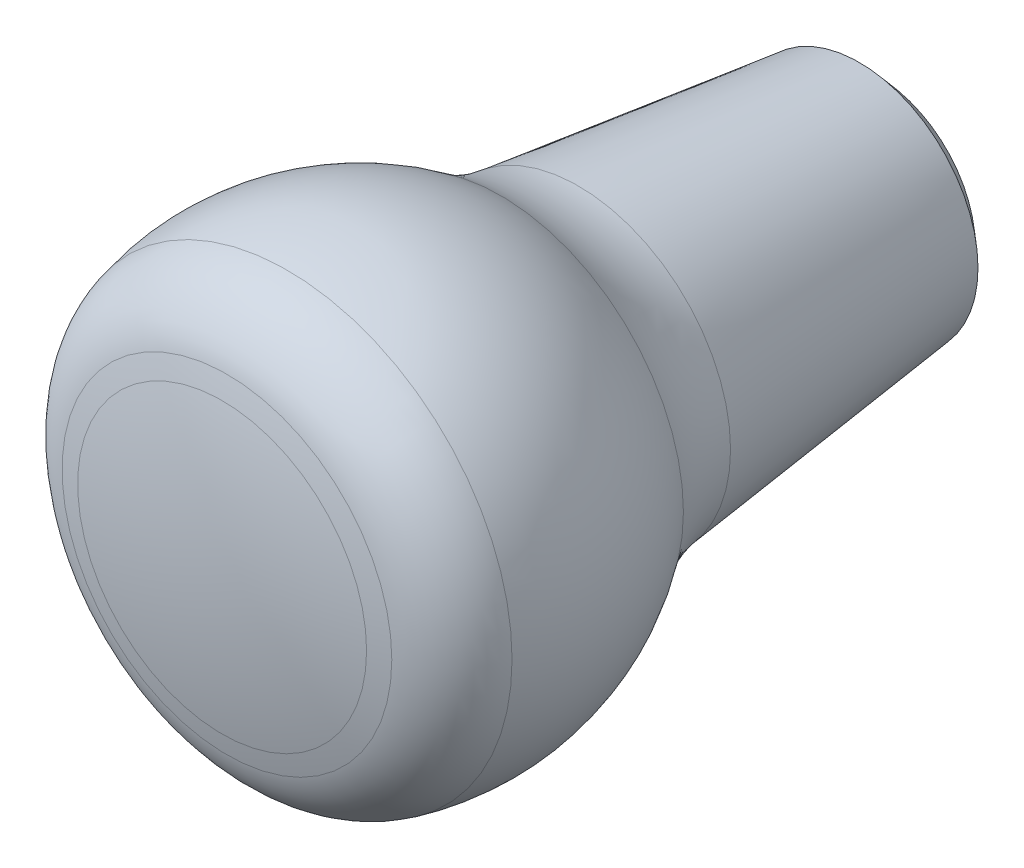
ISO-10303-21;
HEADER;
FILE_DESCRIPTION(('STEP AP214'),'2;1');
FILE_NAME('part.step','',(''),(''),'','','');
FILE_SCHEMA(('AUTOMOTIVE_DESIGN { 1 0 10303 214 1 1 1 1 }'));
ENDSEC;
DATA;
#1=APPLICATION_CONTEXT('core data for automotive mechanical design processes');
#2=APPLICATION_PROTOCOL_DEFINITION('international standard','automotive_design',2000,#1);
#3=PRODUCT_CONTEXT('',#1,'mechanical');
#4=PRODUCT('Part','Part','',(#3));
#5=PRODUCT_RELATED_PRODUCT_CATEGORY('part','',(#4));
#6=PRODUCT_DEFINITION_FORMATION('','',#4);
#7=PRODUCT_DEFINITION_CONTEXT('part definition',#1,'design');
#8=PRODUCT_DEFINITION('design','',#6,#7);
#9=PRODUCT_DEFINITION_SHAPE('','',#8);
#10=(LENGTH_UNIT() NAMED_UNIT(*) SI_UNIT(.MILLI.,.METRE.));
#11=(NAMED_UNIT(*) PLANE_ANGLE_UNIT() SI_UNIT($,.RADIAN.));
#12=(NAMED_UNIT(*) SI_UNIT($,.STERADIAN.) SOLID_ANGLE_UNIT());
#13=UNCERTAINTY_MEASURE_WITH_UNIT(LENGTH_MEASURE(1.E-05),#10,'distance_accuracy_value','');
#14=(GEOMETRIC_REPRESENTATION_CONTEXT(3) GLOBAL_UNCERTAINTY_ASSIGNED_CONTEXT((#13)) GLOBAL_UNIT_ASSIGNED_CONTEXT((#10,
#11,#12)) REPRESENTATION_CONTEXT('',''));
#15=CARTESIAN_POINT('',(0.,0.,0.));
#16=DIRECTION('',(0.,0.,1.));
#17=DIRECTION('',(1.,0.,0.));
#18=AXIS2_PLACEMENT_3D('',#15,#16,#17);
#19=CARTESIAN_POINT('',(0.,5.4,50.));
#20=DIRECTION('',(0.,0.,1.));
#21=DIRECTION('',(1.,0.,0.));
#22=AXIS2_PLACEMENT_3D('',#19,#20,#21);
#23=PLANE('',#22);
#24=CARTESIAN_POINT('',(0.,0.,50.));
#25=DIRECTION('',(0.,0.,1.));
#26=DIRECTION('',(1.,0.,0.));
#27=AXIS2_PLACEMENT_3D('',#24,#25,#26);
#28=CIRCLE('',#27,6.);
#29=CARTESIAN_POINT('',(6.,0.,50.));
#30=VERTEX_POINT('',#29);
#31=EDGE_CURVE('E38',#30,#30,#28,.F.);
#32=ORIENTED_EDGE('',*,*,#31,.T.);
#33=EDGE_LOOP('',(#32));
#34=FACE_BOUND('',#33,.T.);
#35=ADVANCED_FACE('F14',(#34),#23,.F.);
#36=CARTESIAN_POINT('',(0.,0.,25.));
#37=DIRECTION('',(0.,0.,1.));
#38=DIRECTION('',(1.,0.,0.));
#39=AXIS2_PLACEMENT_3D('',#36,#37,#38);
#40=CYLINDRICAL_SURFACE('',#39,6.);
#41=CARTESIAN_POINT('',(0.,0.,0.));
#42=DIRECTION('',(0.,0.,1.));
#43=DIRECTION('',(1.,0.,0.));
#44=AXIS2_PLACEMENT_3D('',#41,#42,#43);
#45=CIRCLE('',#44,6.);
#46=CARTESIAN_POINT('',(6.,0.,0.));
#47=VERTEX_POINT('',#46);
#48=EDGE_CURVE('E59',#47,#47,#45,.T.);
#49=ORIENTED_EDGE('',*,*,#48,.F.);
#50=EDGE_LOOP('',(#49));
#51=FACE_BOUND('',#50,.T.);
#52=ORIENTED_EDGE('',*,*,#31,.F.);
#53=EDGE_LOOP('',(#52));
#54=FACE_BOUND('',#53,.T.);
#55=ADVANCED_FACE('F83',(#51,#54),#40,.F.);
#56=CARTESIAN_POINT('',(0.,-4.75,0.));
#57=DIRECTION('',(0.,0.,-1.));
#58=DIRECTION('',(0.,-1.,0.));
#59=AXIS2_PLACEMENT_3D('',#56,#57,#58);
#60=PLANE('',#59);
#61=CARTESIAN_POINT('',(0.,0.,0.));
#62=DIRECTION('',(0.,0.,1.));
#63=DIRECTION('',(1.,0.,0.));
#64=AXIS2_PLACEMENT_3D('',#61,#62,#63);
#65=CIRCLE('',#64,9.5);
#66=CARTESIAN_POINT('',(9.5,0.,0.));
#67=VERTEX_POINT('',#66);
#68=EDGE_CURVE('E53',#67,#67,#65,.T.);
#69=ORIENTED_EDGE('',*,*,#68,.F.);
#70=EDGE_LOOP('',(#69));
#71=FACE_BOUND('',#70,.T.);
#72=ORIENTED_EDGE('',*,*,#48,.T.);
#73=EDGE_LOOP('',(#72));
#74=FACE_BOUND('',#73,.T.);
#75=ADVANCED_FACE('F79',(#71,#74),#60,.T.);
#76=CARTESIAN_POINT('',(0.,0.,1.72843217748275));
#77=DIRECTION('',(0.,0.,1.));
#78=DIRECTION('',(1.,0.,0.));
#79=AXIS2_PLACEMENT_3D('',#76,#77,#78);
#80=CONICAL_SURFACE('',#79,11.5,0.858106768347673);
#81=CARTESIAN_POINT('',(0.,0.,1.72843217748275));
#82=DIRECTION('',(0.,0.,1.));
#83=DIRECTION('',(0.,-1.,0.));
#84=AXIS2_PLACEMENT_3D('',#81,#82,#83);
#85=CIRCLE('',#84,11.5);
#86=CARTESIAN_POINT('',(0.,-11.5,1.72843217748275));
#87=VERTEX_POINT('',#86);
#88=EDGE_CURVE('E52',#87,#87,#85,.T.);
#89=ORIENTED_EDGE('',*,*,#88,.F.);
#90=EDGE_LOOP('',(#89));
#91=FACE_BOUND('',#90,.T.);
#92=ORIENTED_EDGE('',*,*,#68,.T.);
#93=EDGE_LOOP('',(#92));
#94=FACE_BOUND('',#93,.T.);
#95=ADVANCED_FACE('F76',(#91,#94),#80,.T.);
#96=CARTESIAN_POINT('',(0.,0.,28.9578448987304));
#97=DIRECTION('',(0.,0.,1.));
#98=DIRECTION('',(1.,0.,0.));
#99=AXIS2_PLACEMENT_3D('',#96,#97,#98);
#100=CONICAL_SURFACE('',#99,14.7528672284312,0.118898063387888);
#101=CARTESIAN_POINT('',(0.,0.,28.9578448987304));
#102=DIRECTION('',(0.,0.,1.));
#103=DIRECTION('',(1.,0.,0.));
#104=AXIS2_PLACEMENT_3D('',#101,#102,#103);
#105=CIRCLE('',#104,14.7528672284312);
#106=CARTESIAN_POINT('',(14.7528672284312,0.,28.9578448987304));
#107=VERTEX_POINT('',#106);
#108=EDGE_CURVE('E178',#107,#107,#105,.F.);
#109=ORIENTED_EDGE('',*,*,#108,.T.);
#110=EDGE_LOOP('',(#109));
#111=FACE_BOUND('',#110,.T.);
#112=ORIENTED_EDGE('',*,*,#88,.T.);
#113=EDGE_LOOP('',(#112));
#114=FACE_BOUND('',#113,.T.);
#115=ADVANCED_FACE('F74',(#111,#114),#100,.T.);
#116=CARTESIAN_POINT('',(0.,0.,27.0599549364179));
#117=DIRECTION('',(0.,0.,1.));
#118=DIRECTION('',(1.,0.,0.));
#119=AXIS2_PLACEMENT_3D('',#116,#117,#118);
#120=TOROIDAL_SURFACE('',#119,30.6399064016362,16.);
#121=ORIENTED_EDGE('',*,*,#108,.F.);
#122=EDGE_LOOP('',(#121));
#123=FACE_BOUND('',#122,.T.);
#124=CARTESIAN_POINT('',(0.,0.,36.4804993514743));
#125=DIRECTION('',(0.,0.,1.));
#126=DIRECTION('',(1.,0.,0.));
#127=AXIS2_PLACEMENT_3D('',#124,#125,#126);
#128=CIRCLE('',#127,17.7072600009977);
#129=CARTESIAN_POINT('',(17.7072600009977,0.,36.4804993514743));
#130=VERTEX_POINT('',#129);
#131=EDGE_CURVE('E9',#130,#130,#128,.T.);
#132=ORIENTED_EDGE('',*,*,#131,.F.);
#133=EDGE_LOOP('',(#132));
#134=FACE_BOUND('',#133,.T.);
#135=ADVANCED_FACE('F122',(#123,#134),#120,.F.);
#136=CARTESIAN_POINT('',(-2.5000184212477,0.,51.2001080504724));
#137=DIRECTION('',(0.,1.,0.));
#138=DIRECTION('',(1.,0.,0.));
#139=AXIS2_PLACEMENT_3D('',#136,#137,#138);
#140=CIRCLE('',#139,25.0000196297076);
#141=TRIMMED_CURVE('',#140,(PARAMETER_VALUE(-1.47062824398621)),
(PARAMETER_VALUE(1.47062824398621)),.T.,.PARAMETER.);
#142=CARTESIAN_POINT('',(0.,0.,51.2001080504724));
#143=DIRECTION('',(0.,0.,1.));
#144=AXIS1_PLACEMENT('',#142,#143);
#145=SURFACE_OF_REVOLUTION('',#141,#144);
#146=CARTESIAN_POINT('',(0.,0.,57.1578977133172));
#147=DIRECTION('',(0.,0.,1.));
#148=DIRECTION('',(1.,0.,0.));
#149=AXIS2_PLACEMENT_3D('',#146,#147,#148);
#150=CIRCLE('',#149,21.7797205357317);
#151=CARTESIAN_POINT('',(21.7797205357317,0.,57.1578977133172));
#152=VERTEX_POINT('',#151);
#153=EDGE_CURVE('E27',#152,#152,#150,.F.);
#154=ORIENTED_EDGE('',*,*,#153,.T.);
#155=EDGE_LOOP('',(#154));
#156=FACE_BOUND('',#155,.T.);
#157=ORIENTED_EDGE('',*,*,#131,.T.);
#158=EDGE_LOOP('',(#157));
#159=FACE_BOUND('',#158,.T.);
#160=ADVANCED_FACE('F130',(#156,#159),#145,.F.);
#161=CARTESIAN_POINT('',(0.,0.,55.251386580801));
#162=DIRECTION('',(0.,0.,1.));
#163=DIRECTION('',(1.,0.,0.));
#164=AXIS2_PLACEMENT_3D('',#161,#162,#163);
#165=TOROIDAL_SURFACE('',#164,14.0102198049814,7.99999539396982);
#166=CARTESIAN_POINT('',(0.,0.,63.0059482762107));
#167=DIRECTION('',(0.,0.,1.));
#168=DIRECTION('',(1.,0.,0.));
#169=AXIS2_PLACEMENT_3D('',#166,#167,#168);
#170=CIRCLE('',#169,15.9766122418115);
#171=CARTESIAN_POINT('',(15.9766122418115,0.,63.0059482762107));
#172=VERTEX_POINT('',#171);
#173=EDGE_CURVE('E56',#172,#172,#170,.F.);
#174=ORIENTED_EDGE('',*,*,#173,.T.);
#175=EDGE_LOOP('',(#174));
#176=FACE_BOUND('',#175,.T.);
#177=ORIENTED_EDGE('',*,*,#153,.F.);
#178=EDGE_LOOP('',(#177));
#179=FACE_BOUND('',#178,.T.);
#180=ADVANCED_FACE('F73',(#176,#179),#165,.T.);
#181=CARTESIAN_POINT('',(-0.0116498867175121,0.,-0.0509242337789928));
#182=DIRECTION('',(0.,1.,0.));
#183=DIRECTION('',(1.,0.,0.));
#184=AXIS2_PLACEMENT_3D('',#181,#182,#183);
#185=CIRCLE('',#184,65.0522382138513);
#186=TRIMMED_CURVE('',#185,(PARAMETER_VALUE(-1.57061724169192)),
(PARAMETER_VALUE(1.57061724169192)),.T.,.PARAMETER.);
#187=CARTESIAN_POINT('',(0.,0.,-0.0509242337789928));
#188=DIRECTION('',(0.,0.,1.));
#189=AXIS1_PLACEMENT('',#187,#188);
#190=SURFACE_OF_REVOLUTION('',#186,#189);
#191=CARTESIAN_POINT('',(0.,0.,63.4744042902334));
#192=DIRECTION('',(0.,0.,1.));
#193=DIRECTION('',(1.,0.,0.));
#194=AXIS2_PLACEMENT_3D('',#191,#192,#193);
#195=CIRCLE('',#194,14.);
#196=CARTESIAN_POINT('',(14.,0.,63.4744042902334));
#197=VERTEX_POINT('',#196);
#198=EDGE_CURVE('E32',#197,#197,#195,.F.);
#199=ORIENTED_EDGE('',*,*,#198,.T.);
#200=EDGE_LOOP('',(#199));
#201=FACE_BOUND('',#200,.T.);
#202=ORIENTED_EDGE('',*,*,#173,.F.);
#203=EDGE_LOOP('',(#202));
#204=FACE_BOUND('',#203,.T.);
#205=ADVANCED_FACE('F69',(#201,#204),#190,.F.);
#206=CARTESIAN_POINT('',(0.,0.,9.66338120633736E-13));
#207=DIRECTION('',(0.,0.,1.));
#208=DIRECTION('',(0.,1.,0.));
#209=AXIS2_PLACEMENT_3D('',#206,#207,#208);
#210=SPHERICAL_SURFACE('',#209,64.999999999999);
#211=ORIENTED_EDGE('',*,*,#198,.F.);
#212=CARTESIAN_POINT('',(0.,0.,65.));
#213=CARTESIAN_POINT('',(0.587940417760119,-5.41475823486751E-12,65.0000021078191));
#214=CARTESIAN_POINT('',(1.17588073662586,-1.08295155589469E-11,64.9920229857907));
#215=CARTESIAN_POINT('',(2.35132852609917,-2.16550438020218E-11,64.9601174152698));
#216=CARTESIAN_POINT('',(2.93883599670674,-2.70658147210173E-11,64.9361909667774));
#217=CARTESIAN_POINT('',(4.11298543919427,-3.78793855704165E-11,64.8724058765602));
#218=CARTESIAN_POINT('',(4.69962741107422,-4.32821855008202E-11,64.8325472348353));
#219=CARTESIAN_POINT('',(5.8716139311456,-5.40758364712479E-11,64.736927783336));
#220=CARTESIAN_POINT('',(6.45695847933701,-5.94666875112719E-11,64.6811669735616));
#221=CARTESIAN_POINT('',(7.62591914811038,-7.02324712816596E-11,64.553784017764));
#222=CARTESIAN_POINT('',(8.20953526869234,-7.56074040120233E-11,64.4821618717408));
#223=CARTESIAN_POINT('',(9.37460939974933,-8.63373939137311E-11,64.3231092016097));
#224=CARTESIAN_POINT('',(9.95606741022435,-9.1692451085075E-11,64.2356786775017));
#225=CARTESIAN_POINT('',(11.1163970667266,-1.02378745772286E-10,64.0450729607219));
#226=CARTESIAN_POINT('',(11.6952687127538,-1.07709983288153E-10,63.9418977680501));
#227=CARTESIAN_POINT('',(12.8499998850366,-1.18344717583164E-10,63.7198811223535));
#228=CARTESIAN_POINT('',(13.4258594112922,-1.23648214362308E-10,63.6010396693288));
#229=CARTESIAN_POINT('',(14.,-1.28935880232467E-10,63.4744042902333));
#230=B_SPLINE_CURVE_WITH_KNOTS('',3,(#212,#213,#214,#215,#216,#217,#218,#219,#220,#221,#222,
#223,#224,#225,#226,#227,#228,#229),.UNSPECIFIED.,.F.,.F.,(4,2,2,2,2,2,2,2,4),(0.,
1.76376697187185,3.5275339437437,5.29130091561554,7.05506788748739,8.81883485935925,
10.5826018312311,12.3463688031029,14.1101357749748),.UNSPECIFIED.);
#231=CARTESIAN_POINT('',(0.,0.,65.));
#232=VERTEX_POINT('',#231);
#233=EDGE_CURVE('E36',#232,#197,#230,.T.);
#234=ORIENTED_EDGE('',*,*,#233,.F.);
#235=ORIENTED_EDGE('',*,*,#233,.T.);
#236=EDGE_LOOP('',(#211,#234,#235));
#237=FACE_BOUND('',#236,.T.);
#238=ADVANCED_FACE('F16',(#237),#210,.T.);
#239=CLOSED_SHELL('',(#35,#55,#75,#95,#115,#135,#160,#180,#205,#238));
#240=MANIFOLD_SOLID_BREP('B1',#239);
#241=ADVANCED_BREP_SHAPE_REPRESENTATION('',(#18,#240),#14);
#242=SHAPE_DEFINITION_REPRESENTATION(#9,#241);
ENDSEC;
END-ISO-10303-21;
